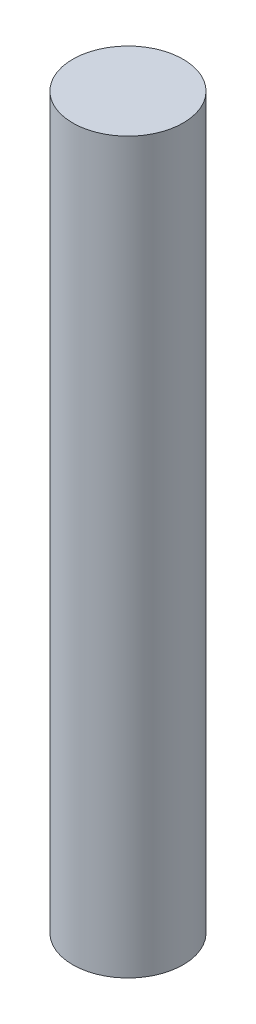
from build123d import *

# Parameters (mm, degrees)
SKIZZE1_R                       = 2.5
AUFSATZ_LINEAR_AUSTRAGEN1_DEPTH = 33


with BuildPart() as part:
    # Skizze1 → Aufsatz-Linear austragen1 (new body)
    with BuildSketch(Plane(origin=(0, 0, 0), x_dir=(1, 0, 0), z_dir=(0, 1, 0))):
        with Locations(Location((0, 0, 0), (0, 0, 270))):
            Circle(SKIZZE1_R)
    extrude(amount=AUFSATZ_LINEAR_AUSTRAGEN1_DEPTH)


solid = part.part
